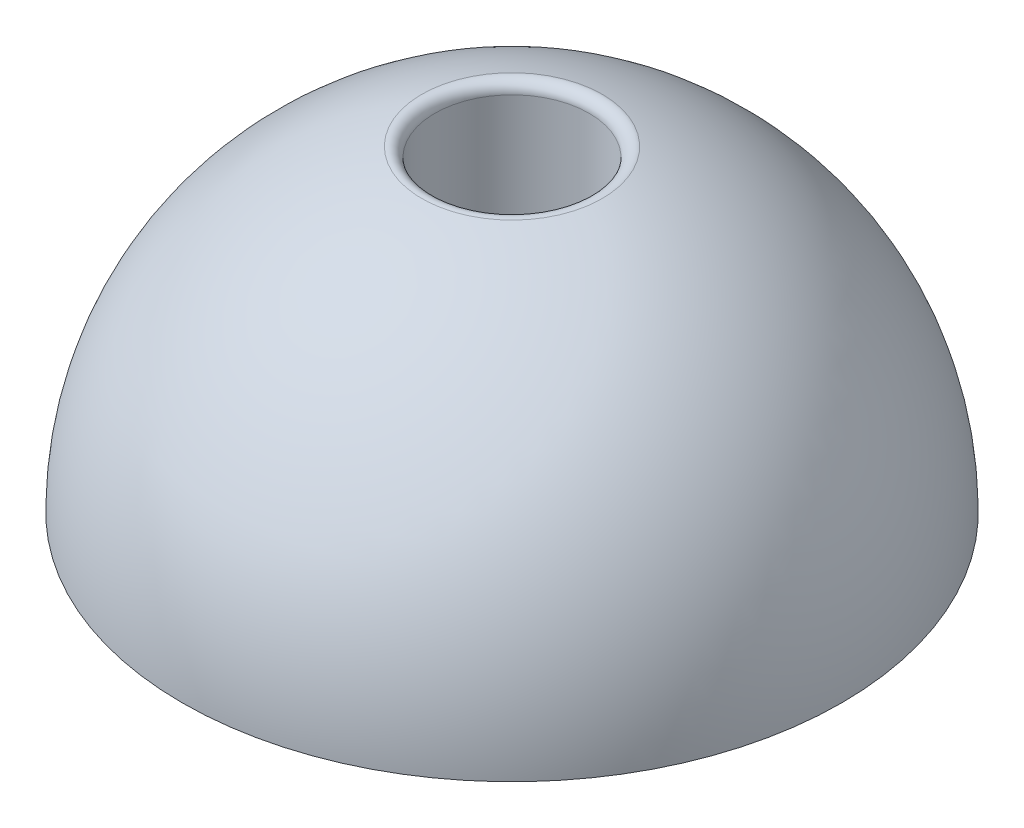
ISO-10303-21;
HEADER;
FILE_DESCRIPTION(('STEP AP214'),'2;1');
FILE_NAME('part.step','',(''),(''),'','','');
FILE_SCHEMA(('AUTOMOTIVE_DESIGN { 1 0 10303 214 1 1 1 1 }'));
ENDSEC;
DATA;
#1=APPLICATION_CONTEXT('core data for automotive mechanical design processes');
#2=APPLICATION_PROTOCOL_DEFINITION('international standard','automotive_design',2000,#1);
#3=PRODUCT_CONTEXT('',#1,'mechanical');
#4=PRODUCT('Part','Part','',(#3));
#5=PRODUCT_RELATED_PRODUCT_CATEGORY('part','',(#4));
#6=PRODUCT_DEFINITION_FORMATION('','',#4);
#7=PRODUCT_DEFINITION_CONTEXT('part definition',#1,'design');
#8=PRODUCT_DEFINITION('design','',#6,#7);
#9=PRODUCT_DEFINITION_SHAPE('','',#8);
#10=(LENGTH_UNIT() NAMED_UNIT(*) SI_UNIT(.MILLI.,.METRE.));
#11=(NAMED_UNIT(*) PLANE_ANGLE_UNIT() SI_UNIT($,.RADIAN.));
#12=(NAMED_UNIT(*) SI_UNIT($,.STERADIAN.) SOLID_ANGLE_UNIT());
#13=UNCERTAINTY_MEASURE_WITH_UNIT(LENGTH_MEASURE(1.E-05),#10,'distance_accuracy_value','');
#14=(GEOMETRIC_REPRESENTATION_CONTEXT(3) GLOBAL_UNCERTAINTY_ASSIGNED_CONTEXT((#13)) GLOBAL_UNIT_ASSIGNED_CONTEXT((#10,
#11,#12)) REPRESENTATION_CONTEXT('',''));
#15=CARTESIAN_POINT('',(0.,0.,0.));
#16=DIRECTION('',(0.,0.,1.));
#17=DIRECTION('',(1.,0.,0.));
#18=AXIS2_PLACEMENT_3D('',#15,#16,#17);
#19=CARTESIAN_POINT('',(0.,0.,0.));
#20=DIRECTION('',(0.,1.,0.));
#21=DIRECTION('',(0.,0.,1.));
#22=AXIS2_PLACEMENT_3D('',#19,#20,#21);
#23=PLANE('',#22);
#24=CARTESIAN_POINT('',(0.,0.,0.));
#25=DIRECTION('',(0.,-1.,0.));
#26=DIRECTION('',(0.,0.,-1.));
#27=AXIS2_PLACEMENT_3D('',#24,#25,#26);
#28=CIRCLE('',#27,9.525);
#29=CARTESIAN_POINT('',(0.,0.,-9.525));
#30=VERTEX_POINT('',#29);
#31=EDGE_CURVE('E53',#30,#30,#28,.T.);
#32=ORIENTED_EDGE('',*,*,#31,.F.);
#33=EDGE_LOOP('',(#32));
#34=FACE_BOUND('',#33,.T.);
#35=CARTESIAN_POINT('',(0.,0.,0.));
#36=DIRECTION('',(0.,1.,0.));
#37=DIRECTION('',(0.,0.,1.));
#38=AXIS2_PLACEMENT_3D('',#35,#36,#37);
#39=CIRCLE('',#38,40.6911409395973);
#40=CARTESIAN_POINT('',(0.,0.,40.6911409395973));
#41=VERTEX_POINT('',#40);
#42=EDGE_CURVE('E49',#41,#41,#39,.T.);
#43=ORIENTED_EDGE('',*,*,#42,.F.);
#44=EDGE_LOOP('',(#43));
#45=FACE_BOUND('',#44,.T.);
#46=ADVANCED_FACE('F38',(#34,#45),#23,.F.);
#47=CARTESIAN_POINT('',(0.,0.,0.));
#48=DIRECTION('',(0.,1.,0.));
#49=DIRECTION('',(1.,0.,0.));
#50=AXIS2_PLACEMENT_3D('',#47,#48,#49);
#51=SPHERICAL_SURFACE('',#50,40.6911409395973);
#52=CARTESIAN_POINT('',(0.,39.135757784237,0.));
#53=DIRECTION('',(0.,-1.,0.));
#54=DIRECTION('',(0.,0.,-1.));
#55=AXIS2_PLACEMENT_3D('',#52,#53,#54);
#56=CIRCLE('',#55,11.1427740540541);
#57=CARTESIAN_POINT('',(0.,39.135757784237,-11.1427740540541));
#58=VERTEX_POINT('',#57);
#59=EDGE_CURVE('E45',#58,#58,#56,.T.);
#60=ORIENTED_EDGE('',*,*,#59,.T.);
#61=EDGE_LOOP('',(#60));
#62=FACE_BOUND('',#61,.T.);
#63=ORIENTED_EDGE('',*,*,#42,.T.);
#64=EDGE_LOOP('',(#63));
#65=FACE_BOUND('',#64,.T.);
#66=ADVANCED_FACE('F63',(#62,#65),#51,.T.);
#67=CARTESIAN_POINT('',(0.,40.6911409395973,0.));
#68=DIRECTION('',(0.,-1.,0.));
#69=DIRECTION('',(0.,0.,-1.));
#70=AXIS2_PLACEMENT_3D('',#67,#68,#69);
#71=CYLINDRICAL_SURFACE('',#70,9.525);
#72=CARTESIAN_POINT('',(0.,37.914302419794,0.));
#73=DIRECTION('',(0.,-1.,0.));
#74=DIRECTION('',(0.,0.,-1.));
#75=AXIS2_PLACEMENT_3D('',#72,#73,#74);
#76=CIRCLE('',#75,9.525);
#77=CARTESIAN_POINT('',(0.,37.914302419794,-9.525));
#78=VERTEX_POINT('',#77);
#79=EDGE_CURVE('E10',#78,#78,#76,.F.);
#80=CARTESIAN_POINT('',(0.,37.914302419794,-9.525));
#81=CARTESIAN_POINT('',(0.,37.5193617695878,-9.525));
#82=CARTESIAN_POINT('',(0.,37.1244211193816,-9.525));
#83=CARTESIAN_POINT('',(0.,36.3345398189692,-9.525));
#84=CARTESIAN_POINT('',(0.,35.939599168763,-9.525));
#85=CARTESIAN_POINT('',(0.,35.1497178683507,-9.525));
#86=CARTESIAN_POINT('',(0.,34.7547772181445,-9.525));
#87=CARTESIAN_POINT('',(0.,33.9648959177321,-9.525));
#88=CARTESIAN_POINT('',(0.,33.5699552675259,-9.525));
#89=CARTESIAN_POINT('',(0.,32.7800739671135,-9.525));
#90=CARTESIAN_POINT('',(0.,32.3851333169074,-9.525));
#91=CARTESIAN_POINT('',(0.,31.595252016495,-9.525));
#92=CARTESIAN_POINT('',(0.,31.2003113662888,-9.525));
#93=CARTESIAN_POINT('',(0.,30.4104300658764,-9.525));
#94=CARTESIAN_POINT('',(0.,30.0154894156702,-9.525));
#95=CARTESIAN_POINT('',(0.,29.2256081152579,-9.525));
#96=CARTESIAN_POINT('',(0.,28.8306674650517,-9.525));
#97=CARTESIAN_POINT('',(0.,28.0407861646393,-9.525));
#98=CARTESIAN_POINT('',(0.,27.6458455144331,-9.525));
#99=CARTESIAN_POINT('',(0.,26.8559642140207,-9.525));
#100=CARTESIAN_POINT('',(0.,26.4610235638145,-9.525));
#101=CARTESIAN_POINT('',(0.,25.6711422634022,-9.525));
#102=CARTESIAN_POINT('',(0.,25.276201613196,-9.525));
#103=CARTESIAN_POINT('',(0.,24.4863203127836,-9.525));
#104=CARTESIAN_POINT('',(0.,24.0913796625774,-9.525));
#105=CARTESIAN_POINT('',(0.,23.3014983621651,-9.525));
#106=CARTESIAN_POINT('',(0.,22.9065577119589,-9.525));
#107=CARTESIAN_POINT('',(0.,22.1166764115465,-9.525));
#108=CARTESIAN_POINT('',(0.,21.7217357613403,-9.525));
#109=CARTESIAN_POINT('',(0.,20.9318544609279,-9.525));
#110=CARTESIAN_POINT('',(0.,20.5369138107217,-9.525));
#111=CARTESIAN_POINT('',(0.,19.7470325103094,-9.525));
#112=CARTESIAN_POINT('',(0.,19.3520918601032,-9.525));
#113=CARTESIAN_POINT('',(0.,18.5622105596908,-9.525));
#114=CARTESIAN_POINT('',(0.,18.1672699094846,-9.525));
#115=CARTESIAN_POINT('',(0.,17.3773886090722,-9.525));
#116=CARTESIAN_POINT('',(0.,16.9824479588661,-9.525));
#117=CARTESIAN_POINT('',(0.,16.1925666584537,-9.525));
#118=CARTESIAN_POINT('',(0.,15.7976260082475,-9.525));
#119=CARTESIAN_POINT('',(0.,15.0077447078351,-9.525));
#120=CARTESIAN_POINT('',(0.,14.6128040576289,-9.525));
#121=CARTESIAN_POINT('',(0.,13.8229227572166,-9.525));
#122=CARTESIAN_POINT('',(0.,13.4279821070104,-9.525));
#123=CARTESIAN_POINT('',(0.,12.638100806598,-9.525));
#124=CARTESIAN_POINT('',(0.,12.2431601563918,-9.525));
#125=CARTESIAN_POINT('',(0.,11.4532788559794,-9.525));
#126=CARTESIAN_POINT('',(0.,11.0583382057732,-9.525));
#127=CARTESIAN_POINT('',(0.,10.2684569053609,-9.525));
#128=CARTESIAN_POINT('',(0.,9.87351625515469,-9.525));
#129=CARTESIAN_POINT('',(0.,9.08363495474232,-9.525));
#130=CARTESIAN_POINT('',(0.,8.68869430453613,-9.525));
#131=CARTESIAN_POINT('',(0.,7.89881300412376,-9.525));
#132=CARTESIAN_POINT('',(0.,7.50387235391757,-9.525));
#133=CARTESIAN_POINT('',(0.,6.71399105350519,-9.525));
#134=CARTESIAN_POINT('',(0.,6.319050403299,-9.525));
#135=CARTESIAN_POINT('',(0.,5.52916910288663,-9.525));
#136=CARTESIAN_POINT('',(0.,5.13422845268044,-9.525));
#137=CARTESIAN_POINT('',(0.,4.34434715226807,-9.525));
#138=CARTESIAN_POINT('',(0.,3.94940650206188,-9.525));
#139=CARTESIAN_POINT('',(0.,3.15952520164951,-9.525));
#140=CARTESIAN_POINT('',(0.,2.76458455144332,-9.525));
#141=CARTESIAN_POINT('',(0.,1.97470325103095,-9.525));
#142=CARTESIAN_POINT('',(0.,1.57976260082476,-9.525));
#143=CARTESIAN_POINT('',(0.,0.789881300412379,-9.525));
#144=CARTESIAN_POINT('',(0.,0.394940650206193,-9.525));
#145=CARTESIAN_POINT('',(0.,0.,-9.525));
#146=B_SPLINE_CURVE_WITH_KNOTS('',3,(#80,#81,#82,#83,#84,#85,#86,#87,#88,#89,#90,#91,#92,#93,
#94,#95,#96,#97,#98,#99,#100,#101,#102,#103,#104,#105,#106,#107,#108,#109,#110,#111,#112,#113,
#114,#115,#116,#117,#118,#119,#120,#121,#122,#123,#124,#125,#126,#127,#128,#129,#130,#131,#132,
#133,#134,#135,#136,#137,#138,#139,#140,#141,#142,#143,#144,#145),.UNSPECIFIED.,.F.,.F.,(4,2,2,
2,2,2,2,2,2,2,2,2,2,2,2,2,2,2,2,2,2,2,2,2,2,2,2,2,2,2,2,2,4),(0.,1.18482195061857,
2.36964390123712,3.55446585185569,4.73928780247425,5.92410975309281,7.10893170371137,
8.29375365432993,9.4785756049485,10.6633975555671,11.8482195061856,13.0330414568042,
14.2178634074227,15.4026853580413,16.5875073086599,17.7723292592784,18.957151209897,
20.1419731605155,21.3267951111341,22.5116170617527,23.6964390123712,24.8812609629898,
26.0660829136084,27.2509048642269,28.4357268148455,29.620548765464,30.8053707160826,
31.9901926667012,33.1750146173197,34.3598365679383,35.5446585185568,36.7294804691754,
37.914302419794),.UNSPECIFIED.);
#147=EDGE_CURVE('BSEAM59',#78,#30,#146,.T.);
#148=ORIENTED_EDGE('',*,*,#79,.T.);
#149=ORIENTED_EDGE('',*,*,#31,.T.);
#150=ORIENTED_EDGE('',*,*,#147,.T.);
#151=ORIENTED_EDGE('',*,*,#147,.F.);
#152=EDGE_LOOP('',(#148,#150,#149,#151));
#153=FACE_BOUND('',#152,.T.);
#154=ADVANCED_FACE('F59',(#153),#71,.F.);
#155=CARTESIAN_POINT('',(0.,37.914302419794,0.));
#156=DIRECTION('',(0.,-1.,0.));
#157=DIRECTION('',(0.,0.,-1.));
#158=AXIS2_PLACEMENT_3D('',#155,#156,#157);
#159=TOROIDAL_SURFACE('',#158,10.795,1.27);
#160=ORIENTED_EDGE('',*,*,#79,.F.);
#161=EDGE_LOOP('',(#160));
#162=FACE_BOUND('',#161,.T.);
#163=ORIENTED_EDGE('',*,*,#59,.F.);
#164=EDGE_LOOP('',(#163));
#165=FACE_BOUND('',#164,.T.);
#166=ADVANCED_FACE('F40',(#162,#165),#159,.T.);
#167=CLOSED_SHELL('',(#46,#66,#154,#166));
#168=MANIFOLD_SOLID_BREP('B2',#167);
#169=ADVANCED_BREP_SHAPE_REPRESENTATION('',(#18,#168),#14);
#170=SHAPE_DEFINITION_REPRESENTATION(#9,#169);
ENDSEC;
END-ISO-10303-21;
